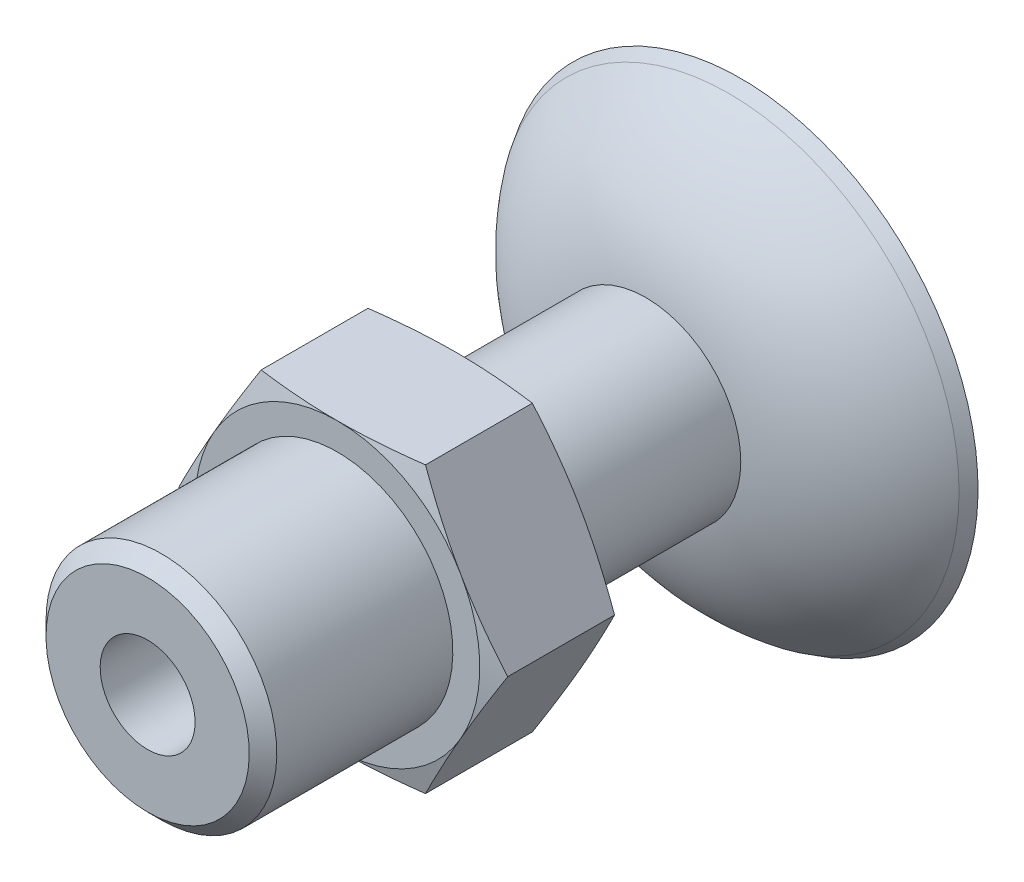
ISO-10303-21;
HEADER;
FILE_DESCRIPTION(('STEP AP214'),'2;1');
FILE_NAME('part.step','',(''),(''),'','','');
FILE_SCHEMA(('AUTOMOTIVE_DESIGN { 1 0 10303 214 1 1 1 1 }'));
ENDSEC;
DATA;
#1=APPLICATION_CONTEXT('core data for automotive mechanical design processes');
#2=APPLICATION_PROTOCOL_DEFINITION('international standard','automotive_design',2000,#1);
#3=PRODUCT_CONTEXT('',#1,'mechanical');
#4=PRODUCT('Part','Part','',(#3));
#5=PRODUCT_RELATED_PRODUCT_CATEGORY('part','',(#4));
#6=PRODUCT_DEFINITION_FORMATION('','',#4);
#7=PRODUCT_DEFINITION_CONTEXT('part definition',#1,'design');
#8=PRODUCT_DEFINITION('design','',#6,#7);
#9=PRODUCT_DEFINITION_SHAPE('','',#8);
#10=(LENGTH_UNIT() NAMED_UNIT(*) SI_UNIT(.MILLI.,.METRE.));
#11=(NAMED_UNIT(*) PLANE_ANGLE_UNIT() SI_UNIT($,.RADIAN.));
#12=(NAMED_UNIT(*) SI_UNIT($,.STERADIAN.) SOLID_ANGLE_UNIT());
#13=UNCERTAINTY_MEASURE_WITH_UNIT(LENGTH_MEASURE(1.E-05),#10,'distance_accuracy_value','');
#14=(GEOMETRIC_REPRESENTATION_CONTEXT(3) GLOBAL_UNCERTAINTY_ASSIGNED_CONTEXT((#13)) GLOBAL_UNIT_ASSIGNED_CONTEXT((#10,
#11,#12)) REPRESENTATION_CONTEXT('',''));
#15=CARTESIAN_POINT('',(0.,0.,0.));
#16=DIRECTION('',(0.,0.,1.));
#17=DIRECTION('',(1.,0.,0.));
#18=AXIS2_PLACEMENT_3D('',#15,#16,#17);
#19=CARTESIAN_POINT('',(6.92820323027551,0.,12.));
#20=DIRECTION('',(0.866025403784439,0.5,0.));
#21=DIRECTION('',(0.,0.,1.));
#22=AXIS2_PLACEMENT_3D('',#19,#20,#21);
#23=PLANE('',#22);
#24=DIRECTION('',(0.,0.,1.));
#25=VECTOR('',#24,1.);
#26=CARTESIAN_POINT('',(3.46410161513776,6.,12.));
#27=LINE('',#26,#25);
#28=CARTESIAN_POINT('',(3.46410161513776,6.,12.2487113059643));
#29=VERTEX_POINT('',#28);
#30=CARTESIAN_POINT('',(3.46410161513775,6.,16.7512886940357));
#31=VERTEX_POINT('',#30);
#32=EDGE_CURVE('E10',#29,#31,#27,.T.);
#33=ORIENTED_EDGE('',*,*,#32,.T.);
#34=CARTESIAN_POINT('',(5.19615242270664,3.00000000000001,17.));
#35=CARTESIAN_POINT('',(5.12404359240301,3.12480967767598,17.0000199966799));
#36=CARTESIAN_POINT('',(5.05188034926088,3.24958799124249,16.9986484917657));
#37=CARTESIAN_POINT('',(4.90798279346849,3.49847134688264,16.9931540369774));
#38=CARTESIAN_POINT('',(4.83624819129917,3.62257653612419,16.9890453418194));
#39=CARTESIAN_POINT('',(4.6926345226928,3.87142043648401,16.9780801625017));
#40=CARTESIAN_POINT('',(4.62075656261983,3.99615917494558,16.9712098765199));
#41=CARTESIAN_POINT('',(4.47601669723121,4.24735284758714,16.9547641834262));
#42=CARTESIAN_POINT('',(4.40315594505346,4.37380590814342,16.9451503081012));
#43=CARTESIAN_POINT('',(4.2592900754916,4.62306506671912,16.9237525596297));
#44=CARTESIAN_POINT('',(4.18828746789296,4.74587821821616,16.912033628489));
#45=CARTESIAN_POINT('',(4.04576334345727,4.99249350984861,16.8862377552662));
#46=CARTESIAN_POINT('',(3.97424314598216,5.11629421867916,16.8721398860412));
#47=CARTESIAN_POINT('',(3.83027325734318,5.36560571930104,16.8416075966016));
#48=CARTESIAN_POINT('',(3.75782595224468,5.49111391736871,16.8251409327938));
#49=CARTESIAN_POINT('',(3.61160134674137,5.74445673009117,16.7898805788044));
#50=CARTESIAN_POINT('',(3.53782665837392,5.87228726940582,16.7710466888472));
#51=CARTESIAN_POINT('',(3.46410161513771,5.99999999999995,16.7512886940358));
#52=B_SPLINE_CURVE_WITH_KNOTS('',3,(#34,#35,#36,#37,#38,#39,#40,#41,#42,#43,#44,#45,#46,#47,#48,
#49,#50,#51),.UNSPECIFIED.,.F.,.F.,(4,2,2,2,2,2,2,2,4),(0.,0.432421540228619,0.862608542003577,
1.29497279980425,1.73372521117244,2.16073850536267,2.59172526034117,3.02925966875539,
3.47560935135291),.UNSPECIFIED.);
#53=CARTESIAN_POINT('',(5.19615242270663,3.,17.));
#54=VERTEX_POINT('',#53);
#55=EDGE_CURVE('E550',#54,#31,#52,.T.);
#56=ORIENTED_EDGE('',*,*,#55,.F.);
#57=CARTESIAN_POINT('',(6.92820323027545,0.,16.7512886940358));
#58=CARTESIAN_POINT('',(6.85446990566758,0.127692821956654,16.7710449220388));
#59=CARTESIAN_POINT('',(6.78066033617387,0.255488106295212,16.7898769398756));
#60=CARTESIAN_POINT('',(6.63438238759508,0.508780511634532,16.8251348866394));
#61=CARTESIAN_POINT('',(6.56191621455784,0.634273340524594,16.841600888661));
#62=CARTESIAN_POINT('',(6.41799291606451,0.883612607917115,16.8721331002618));
#63=CARTESIAN_POINT('',(6.3465368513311,1.00745570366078,16.8862314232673));
#64=CARTESIAN_POINT('',(6.20421306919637,1.25420625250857,16.9120298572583));
#65=CARTESIAN_POINT('',(6.13334596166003,1.37711187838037,16.9237507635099));
#66=CARTESIAN_POINT('',(5.98940836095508,1.62632912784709,16.9451502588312));
#67=CARTESIAN_POINT('',(5.91633055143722,1.75264209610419,16.9547643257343));
#68=CARTESIAN_POINT('',(5.77116669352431,2.00357128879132,16.9712102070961));
#69=CARTESIAN_POINT('',(5.69908163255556,2.12818555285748,16.9780803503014));
#70=CARTESIAN_POINT('',(5.55538561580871,2.37698191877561,16.9890454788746));
#71=CARTESIAN_POINT('',(5.48377408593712,2.50116308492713,16.9931541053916));
#72=CARTESIAN_POINT('',(5.34017760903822,2.75023994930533,16.9986485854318));
#73=CARTESIAN_POINT('',(5.26819267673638,2.87513597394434,17.0000200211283));
#74=CARTESIAN_POINT('',(5.19615242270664,3.00000000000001,17.));
#75=B_SPLINE_CURVE_WITH_KNOTS('',3,(#57,#58,#59,#60,#61,#62,#63,#64,#65,#66,#67,#68,#69,#70,#71,
#72,#73,#74),.UNSPECIFIED.,.F.,.F.,(4,2,2,2,2,2,2,2,4),(0.,0.446310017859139,0.883832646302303,
1.31483340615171,1.74188406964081,2.18059822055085,2.61294971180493,3.04314949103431,
3.47560937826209),.UNSPECIFIED.);
#76=CARTESIAN_POINT('',(6.92820323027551,0.,16.7512886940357));
#77=VERTEX_POINT('',#76);
#78=EDGE_CURVE('E546',#77,#54,#75,.T.);
#79=ORIENTED_EDGE('',*,*,#78,.F.);
#80=DIRECTION('',(0.,0.,1.));
#81=VECTOR('',#80,1.);
#82=CARTESIAN_POINT('',(6.92820323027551,0.,12.));
#83=LINE('',#82,#81);
#84=CARTESIAN_POINT('',(6.92820323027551,0.,12.2487113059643));
#85=VERTEX_POINT('',#84);
#86=EDGE_CURVE('E464',#85,#77,#83,.T.);
#87=ORIENTED_EDGE('',*,*,#86,.F.);
#88=CARTESIAN_POINT('',(5.19615242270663,3.,12.));
#89=CARTESIAN_POINT('',(5.26818635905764,2.87514708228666,11.9999800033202));
#90=CARTESIAN_POINT('',(5.34016592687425,2.75026272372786,12.0013515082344));
#91=CARTESIAN_POINT('',(5.48375645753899,2.50120210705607,12.0068459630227));
#92=CARTESIAN_POINT('',(5.55536740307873,2.37702552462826,12.0109546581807));
#93=CARTESIAN_POINT('',(5.69906570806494,2.12823048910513,12.0219198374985));
#94=CARTESIAN_POINT('',(5.77115364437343,2.00361298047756,12.0287901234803));
#95=CARTESIAN_POINT('',(5.91632381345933,1.75266774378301,12.0452358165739));
#96=CARTESIAN_POINT('',(5.98940500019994,1.6263419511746,12.0548496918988));
#97=CARTESIAN_POINT('',(6.13333682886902,1.377120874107,12.0762474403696));
#98=CARTESIAN_POINT('',(6.20419483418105,1.25422423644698,12.0879663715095));
#99=CARTESIAN_POINT('',(6.34650787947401,1.00748707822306,12.1137622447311));
#100=CARTESIAN_POINT('',(6.41796233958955,0.883648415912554,12.1278601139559));
#101=CARTESIAN_POINT('',(6.56188748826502,0.634311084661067,12.1583924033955));
#102=CARTESIAN_POINT('',(6.63435712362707,0.50881577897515,12.1748590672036));
#103=CARTESIAN_POINT('',(6.78064613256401,0.25551014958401,12.210119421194));
#104=CARTESIAN_POINT('',(6.8544632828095,0.127704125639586,12.2289533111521));
#105=CARTESIAN_POINT('',(6.92820323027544,0.,12.2487113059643));
#106=B_SPLINE_CURVE_WITH_KNOTS('',3,(#88,#89,#90,#91,#92,#93,#94,#95,#96,#97,#98,#99,#100,#101,
#102,#103,#104,#105),.UNSPECIFIED.,.F.,.F.,(4,2,2,2,2,2,2,2,4),(0.,0.432421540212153,
0.862608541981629,1.29497279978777,1.73372521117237,2.16073850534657,2.59172526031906,
3.02925966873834,3.47560935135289),.UNSPECIFIED.);
#107=CARTESIAN_POINT('',(5.19615242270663,3.,12.));
#108=VERTEX_POINT('',#107);
#109=EDGE_CURVE('E690',#108,#85,#106,.T.);
#110=ORIENTED_EDGE('',*,*,#109,.F.);
#111=CARTESIAN_POINT('',(3.46410161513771,5.99999999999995,12.2487113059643));
#112=CARTESIAN_POINT('',(3.53782018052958,5.87229865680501,12.2289550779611));
#113=CARTESIAN_POINT('',(3.61158935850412,5.74448005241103,12.2101230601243));
#114=CARTESIAN_POINT('',(3.75780804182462,5.49115343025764,12.1748651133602));
#115=CARTESIAN_POINT('',(3.83025493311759,5.36564946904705,12.1583991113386));
#116=CARTESIAN_POINT('',(3.97422742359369,5.11633860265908,12.1278668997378));
#117=CARTESIAN_POINT('',(4.04575065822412,4.99253428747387,12.1137685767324));
#118=CARTESIAN_POINT('',(4.1882810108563,4.74590300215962,12.0879701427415));
#119=CARTESIAN_POINT('',(4.25928685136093,4.6230774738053,12.0762492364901));
#120=CARTESIAN_POINT('',(4.4031465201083,4.37381523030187,12.0548497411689));
#121=CARTESIAN_POINT('',(4.47599785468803,4.24737150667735,12.0452356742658));
#122=CARTESIAN_POINT('',(4.62072698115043,3.996191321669,12.028789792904));
#123=CARTESIAN_POINT('',(4.69260356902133,3.87145669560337,12.0219196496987));
#124=CARTESIAN_POINT('',(4.83621953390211,3.62261411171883,12.0109545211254));
#125=CARTESIAN_POINT('',(4.90795781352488,3.49850612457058,12.0068458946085));
#126=CARTESIAN_POINT('',(5.05186646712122,3.24960949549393,12.0013514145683));
#127=CARTESIAN_POINT('',(5.12403713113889,3.12482070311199,11.9999799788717));
#128=CARTESIAN_POINT('',(5.19615242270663,3.,12.));
#129=B_SPLINE_CURVE_WITH_KNOTS('',3,(#111,#112,#113,#114,#115,#116,#117,#118,#119,#120,#121,
#122,#123,#124,#125,#126,#127,#128),.UNSPECIFIED.,.F.,.F.,(4,2,2,2,2,2,2,2,4),(0.,
0.446310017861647,0.883832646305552,1.31483340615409,1.74188406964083,2.18059822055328,
2.61294971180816,3.04314949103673,3.47560937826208),.UNSPECIFIED.);
#130=EDGE_CURVE('E178',#29,#108,#129,.T.);
#131=ORIENTED_EDGE('',*,*,#130,.F.);
#132=EDGE_LOOP('',(#33,#56,#79,#87,#110,#131));
#133=FACE_BOUND('',#132,.T.);
#134=ADVANCED_FACE('F15',(#133),#23,.T.);
#135=CARTESIAN_POINT('',(3.46410161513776,6.,12.));
#136=DIRECTION('',(0.,1.,0.));
#137=DIRECTION('',(-1.,0.,0.));
#138=AXIS2_PLACEMENT_3D('',#135,#136,#137);
#139=PLANE('',#138);
#140=DIRECTION('',(0.,0.,1.));
#141=VECTOR('',#140,1.);
#142=CARTESIAN_POINT('',(-3.46410161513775,6.,12.));
#143=LINE('',#142,#141);
#144=CARTESIAN_POINT('',(-3.46410161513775,6.,12.2487113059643));
#145=VERTEX_POINT('',#144);
#146=CARTESIAN_POINT('',(-3.46410161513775,6.,16.7512886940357));
#147=VERTEX_POINT('',#146);
#148=EDGE_CURVE('E29',#145,#147,#143,.T.);
#149=ORIENTED_EDGE('',*,*,#148,.T.);
#150=CARTESIAN_POINT('',(0.,6.00000000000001,17.));
#151=CARTESIAN_POINT('',(-0.144124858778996,5.99995669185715,17.0000200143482));
#152=CARTESIAN_POINT('',(-0.288249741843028,5.99985529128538,16.998647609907));
#153=CARTESIAN_POINT('',(-0.575724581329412,5.99969177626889,16.9931504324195));
#154=CARTESIAN_POINT('',(-0.719074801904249,5.9996294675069,16.9890394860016));
#155=CARTESIAN_POINT('',(-1.00641973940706,5.99969625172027,16.9780688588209));
#156=CARTESIAN_POINT('',(-1.15041390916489,5.99982634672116,16.9711949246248));
#157=CARTESIAN_POINT('',(-1.44040510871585,6.00008659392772,16.9547411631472));
#158=CARTESIAN_POINT('',(-1.58639991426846,6.00021671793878,16.9451224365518));
#159=CARTESIAN_POINT('',(-1.87425873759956,6.00025188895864,16.9237187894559));
#160=CARTESIAN_POINT('',(-2.01612766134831,6.0001629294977,16.9119995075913));
#161=CARTESIAN_POINT('',(-2.30096544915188,6.00002759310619,16.8862047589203));
#162=CARTESIAN_POINT('',(-2.44393243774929,5.99998161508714,16.8721086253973));
#163=CARTESIAN_POINT('',(-2.73179478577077,5.9999399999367,16.8415817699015));
#164=CARTESIAN_POINT('',(-2.87668673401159,5.99994513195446,16.8251190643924));
#165=CARTESIAN_POINT('',(-3.1691318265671,5.99997062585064,16.7898686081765));
#166=CARTESIAN_POINT('',(-3.31668016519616,5.99999129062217,16.7710409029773));
#167=CARTESIAN_POINT('',(-3.46410161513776,6.00000000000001,16.7512886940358));
#168=B_SPLINE_CURVE_WITH_KNOTS('',3,(#150,#151,#152,#153,#154,#155,#156,#157,#158,#159,#160,
#161,#162,#163,#164,#165,#166,#167),.UNSPECIFIED.,.F.,.F.,(4,2,2,2,2,2,2,2,4),(0.,
0.432367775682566,0.862568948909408,1.29501848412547,1.73393012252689,2.16096837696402,
2.59193173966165,3.02939030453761,3.47560819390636),.UNSPECIFIED.);
#169=CARTESIAN_POINT('',(0.,6.,17.));
#170=VERTEX_POINT('',#169);
#171=EDGE_CURVE('E500',#170,#147,#168,.T.);
#172=ORIENTED_EDGE('',*,*,#171,.F.);
#173=CARTESIAN_POINT('',(3.46410161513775,6.00000000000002,16.7512886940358));
#174=CARTESIAN_POINT('',(3.31726869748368,5.99999159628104,16.7709619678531));
#175=CARTESIAN_POINT('',(3.17031004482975,5.99996749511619,16.7897190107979));
#176=CARTESIAN_POINT('',(2.8790373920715,5.99993021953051,16.8248474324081));
#177=CARTESIAN_POINT('',(2.73472816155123,5.9999168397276,16.8412584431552));
#178=CARTESIAN_POINT('',(2.44803367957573,5.99993958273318,16.8717010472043));
#179=CARTESIAN_POINT('',(2.30565182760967,5.99997497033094,16.8857644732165));
#180=CARTESIAN_POINT('',(2.02199764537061,6.00008886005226,16.9115131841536));
#181=CARTESIAN_POINT('',(1.88072720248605,6.00016696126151,16.923219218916));
#182=CARTESIAN_POINT('',(1.59291852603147,6.00012156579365,16.9447025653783));
#183=CARTESIAN_POINT('',(1.44637393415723,5.99999070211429,16.9543951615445));
#184=CARTESIAN_POINT('',(1.15526705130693,5.99974077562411,16.9709752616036));
#185=CARTESIAN_POINT('',(1.01070698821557,5.99962156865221,16.9779015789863));
#186=CARTESIAN_POINT('',(0.722199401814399,5.99958067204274,16.9889562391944));
#187=CARTESIAN_POINT('',(0.578252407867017,5.99965800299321,16.9930983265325));
#188=CARTESIAN_POINT('',(0.289537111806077,5.99984558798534,16.9986377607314));
#189=CARTESIAN_POINT('',(0.144768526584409,5.99995601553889,17.0000203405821));
#190=CARTESIAN_POINT('',(0.,6.00000000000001,17.));
#191=B_SPLINE_CURVE_WITH_KNOTS('',3,(#173,#174,#175,#176,#177,#178,#179,#180,#181,#182,#183,
#184,#185,#186,#187,#188,#189,#190),.UNSPECIFIED.,.F.,.F.,(4,2,2,2,2,2,2,2,4),(0.,
0.444436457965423,0.880140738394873,1.30934776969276,1.73459368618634,2.17516540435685,
2.6093178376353,3.04131099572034,3.47560975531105),.UNSPECIFIED.);
#192=EDGE_CURVE('E585',#31,#170,#191,.T.);
#193=ORIENTED_EDGE('',*,*,#192,.F.);
#194=ORIENTED_EDGE('',*,*,#32,.F.);
#195=CARTESIAN_POINT('',(0.,6.,12.));
#196=CARTESIAN_POINT('',(0.144124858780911,5.99995669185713,11.9999799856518));
#197=CARTESIAN_POINT('',(0.288249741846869,5.99985529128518,12.001352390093));
#198=CARTESIAN_POINT('',(0.575724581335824,5.99969177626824,12.0068495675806));
#199=CARTESIAN_POINT('',(0.719074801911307,5.99962946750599,12.0109605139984));
#200=CARTESIAN_POINT('',(1.00641973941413,5.99969625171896,12.0219311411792));
#201=CARTESIAN_POINT('',(1.15041390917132,5.99982634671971,12.0288050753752));
#202=CARTESIAN_POINT('',(1.4404051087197,6.00008659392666,12.0452588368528));
#203=CARTESIAN_POINT('',(1.58639991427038,6.00021671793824,12.0548775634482));
#204=CARTESIAN_POINT('',(1.87425873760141,6.00025188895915,12.0762812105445));
#205=CARTESIAN_POINT('',(2.01612766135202,6.00016292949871,12.0880004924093));
#206=CARTESIAN_POINT('',(2.30096544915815,6.0000275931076,12.1137952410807));
#207=CARTESIAN_POINT('',(2.44393243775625,5.99998161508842,12.1278913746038));
#208=CARTESIAN_POINT('',(2.73179478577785,5.9999399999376,12.1584182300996));
#209=CARTESIAN_POINT('',(2.87668673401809,5.99994513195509,12.1748809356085));
#210=CARTESIAN_POINT('',(3.16913182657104,5.99997062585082,12.210131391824));
#211=CARTESIAN_POINT('',(3.31668016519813,5.99999129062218,12.228959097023));
#212=CARTESIAN_POINT('',(3.46410161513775,6.00000000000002,12.2487113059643));
#213=B_SPLINE_CURVE_WITH_KNOTS('',3,(#195,#196,#197,#198,#199,#200,#201,#202,#203,#204,#205,
#206,#207,#208,#209,#210,#211,#212),.UNSPECIFIED.,.F.,.F.,(4,2,2,2,2,2,2,2,4),(0.,
0.432367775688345,0.862568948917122,1.29501848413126,1.73393012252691,2.16096837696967,
2.59193173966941,3.02939030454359,3.47560819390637),.UNSPECIFIED.);
#214=CARTESIAN_POINT('',(0.,6.,12.));
#215=VERTEX_POINT('',#214);
#216=EDGE_CURVE('E186',#215,#29,#213,.T.);
#217=ORIENTED_EDGE('',*,*,#216,.F.);
#218=CARTESIAN_POINT('',(-3.46410161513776,6.00000000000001,12.2487113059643));
#219=CARTESIAN_POINT('',(-3.31726869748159,5.99999159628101,12.2290380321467));
#220=CARTESIAN_POINT('',(-3.17031004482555,5.99996749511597,12.2102809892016));
#221=CARTESIAN_POINT('',(-2.87903739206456,5.99993021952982,12.1751525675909));
#222=CARTESIAN_POINT('',(-2.73472816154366,5.99991683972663,12.1587415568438));
#223=CARTESIAN_POINT('',(-2.44803367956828,5.9999395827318,12.1282989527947));
#224=CARTESIAN_POINT('',(-2.30565182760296,5.99997497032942,12.1142355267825));
#225=CARTESIAN_POINT('',(-2.02199764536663,6.00008886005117,12.0884868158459));
#226=CARTESIAN_POINT('',(-1.88072720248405,6.00016696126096,12.0767807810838));
#227=CARTESIAN_POINT('',(-1.5929185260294,6.00012156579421,12.0552974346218));
#228=CARTESIAN_POINT('',(-1.4463739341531,5.99999070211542,12.0456048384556));
#229=CARTESIAN_POINT('',(-1.15526705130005,5.99974077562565,12.0290247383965));
#230=CARTESIAN_POINT('',(-1.01070698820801,5.9996215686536,12.0220984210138));
#231=CARTESIAN_POINT('',(-0.722199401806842,5.99958067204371,12.0110437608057));
#232=CARTESIAN_POINT('',(-0.578252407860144,5.99965800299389,12.0069016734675));
#233=CARTESIAN_POINT('',(-0.289537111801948,5.99984558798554,12.0013622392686));
#234=CARTESIAN_POINT('',(-0.144768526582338,5.9999560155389,11.9999796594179));
#235=CARTESIAN_POINT('',(0.,6.,12.));
#236=B_SPLINE_CURVE_WITH_KNOTS('',3,(#218,#219,#220,#221,#222,#223,#224,#225,#226,#227,#228,
#229,#230,#231,#232,#233,#234,#235),.UNSPECIFIED.,.F.,.F.,(4,2,2,2,2,2,2,2,4),(0.,
0.44443645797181,0.880140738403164,1.3093477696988,1.73459368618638,2.17516540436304,
2.60931783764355,3.04131099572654,3.47560975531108),.UNSPECIFIED.);
#237=EDGE_CURVE('E652',#145,#215,#236,.T.);
#238=ORIENTED_EDGE('',*,*,#237,.F.);
#239=EDGE_LOOP('',(#149,#172,#193,#194,#217,#238));
#240=FACE_BOUND('',#239,.T.);
#241=ADVANCED_FACE('F247',(#240),#139,.T.);
#242=CARTESIAN_POINT('',(-3.46410161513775,6.,12.));
#243=DIRECTION('',(-0.866025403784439,0.5,0.));
#244=DIRECTION('',(0.,0.,-1.));
#245=AXIS2_PLACEMENT_3D('',#242,#243,#244);
#246=PLANE('',#245);
#247=DIRECTION('',(0.,0.,1.));
#248=VECTOR('',#247,1.);
#249=CARTESIAN_POINT('',(-6.92820323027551,0.,12.));
#250=LINE('',#249,#248);
#251=CARTESIAN_POINT('',(-6.92820323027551,0.,12.2487113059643));
#252=VERTEX_POINT('',#251);
#253=CARTESIAN_POINT('',(-6.92820323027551,0.,16.7512886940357));
#254=VERTEX_POINT('',#253);
#255=EDGE_CURVE('E593',#252,#254,#250,.T.);
#256=ORIENTED_EDGE('',*,*,#255,.T.);
#257=CARTESIAN_POINT('',(-5.19615242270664,3.,17.));
#258=CARTESIAN_POINT('',(-5.26818635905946,2.87514708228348,17.0000199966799));
#259=CARTESIAN_POINT('',(-5.3401659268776,2.75026272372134,16.9986484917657));
#260=CARTESIAN_POINT('',(-5.48375645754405,2.5012021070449,16.9931540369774));
#261=CARTESIAN_POINT('',(-5.55536740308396,2.37702552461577,16.9890453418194));
#262=CARTESIAN_POINT('',(-5.69906570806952,2.12823048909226,16.9780801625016));
#263=CARTESIAN_POINT('',(-5.77115364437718,2.00361298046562,16.9712098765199));
#264=CARTESIAN_POINT('',(-5.91632381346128,1.75266774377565,16.9547641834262));
#265=CARTESIAN_POINT('',(-5.98940500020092,1.62634195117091,16.9451503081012));
#266=CARTESIAN_POINT('',(-6.13333682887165,1.37712087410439,16.9237525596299));
#267=CARTESIAN_POINT('',(-6.20419483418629,1.25422423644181,16.9120336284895));
#268=CARTESIAN_POINT('',(-6.34650787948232,1.00748707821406,16.8862377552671));
#269=CARTESIAN_POINT('',(-6.41796233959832,0.883648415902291,16.8721398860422));
#270=CARTESIAN_POINT('',(-6.56188748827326,0.634311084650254,16.8416075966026));
#271=CARTESIAN_POINT('',(-6.63435712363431,0.508815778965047,16.8251409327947));
#272=CARTESIAN_POINT('',(-6.78064613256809,0.255510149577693,16.789880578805));
#273=CARTESIAN_POINT('',(-6.85446328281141,0.127704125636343,16.7710466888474));
#274=CARTESIAN_POINT('',(-6.92820323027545,0.,16.7512886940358));
#275=B_SPLINE_CURVE_WITH_KNOTS('',3,(#257,#258,#259,#260,#261,#262,#263,#264,#265,#266,#267,
#268,#269,#270,#271,#272,#273,#274),.UNSPECIFIED.,.F.,.F.,(4,2,2,2,2,2,2,2,4),(0.,
0.432421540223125,0.86260854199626,1.29497279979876,1.73372521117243,2.16073850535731,
2.5917252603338,3.02925966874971,3.47560935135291),.UNSPECIFIED.);
#276=CARTESIAN_POINT('',(-5.19615242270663,3.,17.));
#277=VERTEX_POINT('',#276);
#278=EDGE_CURVE('E233',#277,#254,#275,.T.);
#279=ORIENTED_EDGE('',*,*,#278,.F.);
#280=CARTESIAN_POINT('',(-3.46410161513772,5.99999999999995,16.7512886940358));
#281=CARTESIAN_POINT('',(-3.53782018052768,5.87229865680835,16.7710449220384));
#282=CARTESIAN_POINT('',(-3.6115893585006,5.74448005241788,16.7898769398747));
#283=CARTESIAN_POINT('',(-3.75780804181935,5.49115343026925,16.825134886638));
#284=CARTESIAN_POINT('',(-3.8302549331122,5.36564946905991,16.8416008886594));
#285=CARTESIAN_POINT('',(-3.97422742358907,5.11633860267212,16.8721331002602));
#286=CARTESIAN_POINT('',(-4.04575065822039,4.99253428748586,16.8862314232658));
#287=CARTESIAN_POINT('',(-4.18828101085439,4.74590300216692,16.9120298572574));
#288=CARTESIAN_POINT('',(-4.25928685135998,4.62307747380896,16.9237507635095));
#289=CARTESIAN_POINT('',(-4.40314652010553,4.37381523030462,16.9451502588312));
#290=CARTESIAN_POINT('',(-4.4759978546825,4.24737150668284,16.9547643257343));
#291=CARTESIAN_POINT('',(-4.62072698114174,3.99619132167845,16.9712102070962));
#292=CARTESIAN_POINT('',(-4.69260356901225,3.87145669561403,16.9780803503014));
#293=CARTESIAN_POINT('',(-4.8362195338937,3.62261411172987,16.9890454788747));
#294=CARTESIAN_POINT('',(-4.90795781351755,3.49850612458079,16.9931541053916));
#295=CARTESIAN_POINT('',(-5.05186646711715,3.24960949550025,16.9986485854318));
#296=CARTESIAN_POINT('',(-5.12403713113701,3.12482070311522,17.0000200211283));
#297=CARTESIAN_POINT('',(-5.19615242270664,3.,17.));
#298=B_SPLINE_CURVE_WITH_KNOTS('',3,(#280,#281,#282,#283,#284,#285,#286,#287,#288,#289,#290,
#291,#292,#293,#294,#295,#296,#297),.UNSPECIFIED.,.F.,.F.,(4,2,2,2,2,2,2,2,4),(0.,
0.446310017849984,0.883832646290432,1.31483340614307,1.74188406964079,2.18059822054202,
2.61294971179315,3.04314949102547,3.47560937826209),.UNSPECIFIED.);
#299=EDGE_CURVE('E525',#147,#277,#298,.T.);
#300=ORIENTED_EDGE('',*,*,#299,.F.);
#301=ORIENTED_EDGE('',*,*,#148,.F.);
#302=CARTESIAN_POINT('',(-5.19615242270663,3.,12.));
#303=CARTESIAN_POINT('',(-5.12404359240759,3.12480967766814,11.9999800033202));
#304=CARTESIAN_POINT('',(-5.05188034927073,3.24958799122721,12.0013515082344));
#305=CARTESIAN_POINT('',(-4.90798279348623,3.49847134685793,12.0068459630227));
#306=CARTESIAN_POINT('',(-4.83624819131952,3.62257653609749,12.0109546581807));
#307=CARTESIAN_POINT('',(-4.69263452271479,3.87142043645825,12.0219198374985));
#308=CARTESIAN_POINT('',(-4.62075656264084,3.99615917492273,12.0287901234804));
#309=CARTESIAN_POINT('',(-4.47601669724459,4.24735284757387,12.045235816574));
#310=CARTESIAN_POINT('',(-4.40315594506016,4.37380590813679,12.0548496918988));
#311=CARTESIAN_POINT('',(-4.25929007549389,4.62306506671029,12.0762474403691));
#312=CARTESIAN_POINT('',(-4.18828746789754,4.74587821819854,12.0879663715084));
#313=CARTESIAN_POINT('',(-4.04576334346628,4.99249350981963,12.1137622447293));
#314=CARTESIAN_POINT('',(-3.97424314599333,5.11629421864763,12.127860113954));
#315=CARTESIAN_POINT('',(-3.83027325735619,5.36560571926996,12.1583924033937));
#316=CARTESIAN_POINT('',(-3.7578259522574,5.49111391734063,12.1748590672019));
#317=CARTESIAN_POINT('',(-3.61160134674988,5.74445673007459,12.210119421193));
#318=CARTESIAN_POINT('',(-3.53782665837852,5.87228726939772,12.2289533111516));
#319=CARTESIAN_POINT('',(-3.46410161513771,5.99999999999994,12.2487113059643));
#320=B_SPLINE_CURVE_WITH_KNOTS('',3,(#302,#303,#304,#305,#306,#307,#308,#309,#310,#311,#312,
#313,#314,#315,#316,#317,#318,#319),.UNSPECIFIED.,.F.,.F.,(4,2,2,2,2,2,2,2,4),(0.,
0.432421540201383,0.862608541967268,1.294972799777,1.73372521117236,2.16073850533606,
2.59172526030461,3.0292596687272,3.47560935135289),.UNSPECIFIED.);
#321=CARTESIAN_POINT('',(-5.19615242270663,3.,12.));
#322=VERTEX_POINT('',#321);
#323=EDGE_CURVE('E648',#322,#145,#320,.T.);
#324=ORIENTED_EDGE('',*,*,#323,.F.);
#325=CARTESIAN_POINT('',(-6.92820323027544,0.,12.2487113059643));
#326=CARTESIAN_POINT('',(-6.85446990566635,0.127692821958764,12.2289550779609));
#327=CARTESIAN_POINT('',(-6.78066033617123,0.255488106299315,12.2101230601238));
#328=CARTESIAN_POINT('',(-6.63438238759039,0.508780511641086,12.1748651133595));
#329=CARTESIAN_POINT('',(-6.5619162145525,0.634273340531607,12.1583991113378));
#330=CARTESIAN_POINT('',(-6.41799291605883,0.883612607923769,12.127866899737));
#331=CARTESIAN_POINT('',(-6.34653685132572,1.00745570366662,12.1137685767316));
#332=CARTESIAN_POINT('',(-6.20421306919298,1.25420625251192,12.0879701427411));
#333=CARTESIAN_POINT('',(-6.13334596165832,1.37711187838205,12.0762492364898));
#334=CARTESIAN_POINT('',(-5.98940836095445,1.62632912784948,12.0548497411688));
#335=CARTESIAN_POINT('',(-5.91633055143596,1.75264209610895,12.0452356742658));
#336=CARTESIAN_POINT('',(-5.77116669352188,2.00357128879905,12.028789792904));
#337=CARTESIAN_POINT('',(-5.69908163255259,2.12818555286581,12.0219196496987));
#338=CARTESIAN_POINT('',(-5.55538561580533,2.37698191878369,12.0109545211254));
#339=CARTESIAN_POINT('',(-5.48377408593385,2.50116308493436,12.0068458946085));
#340=CARTESIAN_POINT('',(-5.34017760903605,2.75023994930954,12.0013514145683));
#341=CARTESIAN_POINT('',(-5.2681926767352,2.87513597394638,11.9999799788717));
#342=CARTESIAN_POINT('',(-5.19615242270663,3.,12.));
#343=B_SPLINE_CURVE_WITH_KNOTS('',3,(#325,#326,#327,#328,#329,#330,#331,#332,#333,#334,#335,
#336,#337,#338,#339,#340,#341,#342),.UNSPECIFIED.,.F.,.F.,(4,2,2,2,2,2,2,2,4),(0.,
0.446310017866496,0.883832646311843,1.31483340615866,1.74188406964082,2.18059822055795,
2.6129497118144,3.0431494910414,3.47560937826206),.UNSPECIFIED.);
#344=EDGE_CURVE('E286',#252,#322,#343,.T.);
#345=ORIENTED_EDGE('',*,*,#344,.F.);
#346=EDGE_LOOP('',(#256,#279,#300,#301,#324,#345));
#347=FACE_BOUND('',#346,.T.);
#348=ADVANCED_FACE('F237',(#347),#246,.T.);
#349=CARTESIAN_POINT('',(-6.92820323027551,0.,12.));
#350=DIRECTION('',(-0.866025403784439,-0.5,0.));
#351=DIRECTION('',(0.,0.,-1.));
#352=AXIS2_PLACEMENT_3D('',#349,#350,#351);
#353=PLANE('',#352);
#354=DIRECTION('',(0.,0.,1.));
#355=VECTOR('',#354,1.);
#356=CARTESIAN_POINT('',(-3.46410161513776,-6.,12.));
#357=LINE('',#356,#355);
#358=CARTESIAN_POINT('',(-3.46410161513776,-6.,12.2487113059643));
#359=VERTEX_POINT('',#358);
#360=CARTESIAN_POINT('',(-3.46410161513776,-6.,16.7512886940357));
#361=VERTEX_POINT('',#360);
#362=EDGE_CURVE('E463',#359,#361,#357,.T.);
#363=ORIENTED_EDGE('',*,*,#362,.T.);
#364=CARTESIAN_POINT('',(-5.19615242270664,-3.,17.));
#365=CARTESIAN_POINT('',(-5.12404359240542,-3.12480967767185,17.0000199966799));
#366=CARTESIAN_POINT('',(-5.05188034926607,-3.24958799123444,16.9986484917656));
#367=CARTESIAN_POINT('',(-4.90798279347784,-3.49847134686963,16.9931540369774));
#368=CARTESIAN_POINT('',(-4.83624819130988,-3.62257653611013,16.9890453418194));
#369=CARTESIAN_POINT('',(-4.69263452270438,-3.87142043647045,16.9780801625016));
#370=CARTESIAN_POINT('',(-4.6207565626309,-3.99615917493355,16.9712098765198));
#371=CARTESIAN_POINT('',(-4.47601669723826,-4.24735284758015,16.9547641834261));
#372=CARTESIAN_POINT('',(-4.403155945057,-4.37380590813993,16.9451503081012));
#373=CARTESIAN_POINT('',(-4.25929007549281,-4.62306506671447,16.9237525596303));
#374=CARTESIAN_POINT('',(-4.18828746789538,-4.74587821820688,16.9120336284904));
#375=CARTESIAN_POINT('',(-4.04576334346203,-4.99249350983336,16.8862377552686));
#376=CARTESIAN_POINT('',(-3.97424314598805,-5.11629421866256,16.8721398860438));
#377=CARTESIAN_POINT('',(-3.83027325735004,-5.36560571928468,16.8416075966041));
#378=CARTESIAN_POINT('',(-3.75782595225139,-5.49111391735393,16.8251409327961));
#379=CARTESIAN_POINT('',(-3.61160134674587,-5.74445673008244,16.7898805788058));
#380=CARTESIAN_POINT('',(-3.53782665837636,-5.87228726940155,16.7710466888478));
#381=CARTESIAN_POINT('',(-3.46410161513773,-5.99999999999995,16.7512886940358));
#382=B_SPLINE_CURVE_WITH_KNOTS('',3,(#364,#365,#366,#367,#368,#369,#370,#371,#372,#373,#374,
#375,#376,#377,#378,#379,#380,#381),.UNSPECIFIED.,.F.,.F.,(4,2,2,2,2,2,2,2,4),(0.,
0.432421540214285,0.862608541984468,1.2949727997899,1.7337252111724,2.16073850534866,
2.59172526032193,3.02925966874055,3.47560935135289),.UNSPECIFIED.);
#383=CARTESIAN_POINT('',(-5.19615242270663,-3.,17.));
#384=VERTEX_POINT('',#383);
#385=EDGE_CURVE('E167',#384,#361,#382,.T.);
#386=ORIENTED_EDGE('',*,*,#385,.F.);
#387=CARTESIAN_POINT('',(-6.92820323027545,0.,16.7512886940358));
#388=CARTESIAN_POINT('',(-6.85446990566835,-0.12769282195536,16.7710449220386));
#389=CARTESIAN_POINT('',(-6.78066033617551,-0.25548810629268,16.7898769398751));
#390=CARTESIAN_POINT('',(-6.634382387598,-0.508780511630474,16.8251348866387));
#391=CARTESIAN_POINT('',(-6.56191621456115,-0.634273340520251,16.8416008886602));
#392=CARTESIAN_POINT('',(-6.41799291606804,-0.883612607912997,16.872133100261));
#393=CARTESIAN_POINT('',(-6.34653685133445,-1.00745570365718,16.8862314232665));
#394=CARTESIAN_POINT('',(-6.20421306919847,-1.25420625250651,16.9120298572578));
#395=CARTESIAN_POINT('',(-6.13334596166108,-1.37711187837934,16.9237507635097));
#396=CARTESIAN_POINT('',(-5.98940836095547,-1.62632912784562,16.9451502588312));
#397=CARTESIAN_POINT('',(-5.916330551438,-1.75264209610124,16.9547643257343));
#398=CARTESIAN_POINT('',(-5.77116669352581,-2.00357128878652,16.9712102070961));
#399=CARTESIAN_POINT('',(-5.69908163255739,-2.1281855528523,16.9780803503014));
#400=CARTESIAN_POINT('',(-5.55538561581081,-2.37698191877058,16.9890454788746));
#401=CARTESIAN_POINT('',(-5.48377408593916,-2.50116308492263,16.9931541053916));
#402=CARTESIAN_POINT('',(-5.34017760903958,-2.7502399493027,16.9986485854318));
#403=CARTESIAN_POINT('',(-5.26819267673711,-2.87513597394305,17.0000200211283));
#404=CARTESIAN_POINT('',(-5.19615242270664,-3.,17.));
#405=B_SPLINE_CURVE_WITH_KNOTS('',3,(#387,#388,#389,#390,#391,#392,#393,#394,#395,#396,#397,
#398,#399,#400,#401,#402,#403,#404),.UNSPECIFIED.,.F.,.F.,(4,2,2,2,2,2,2,2,4),(0.,
0.446310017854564,0.88383264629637,1.3148334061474,1.7418840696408,2.18059822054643,
2.61294971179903,3.04314949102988,3.47560937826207),.UNSPECIFIED.);
#406=EDGE_CURVE('E159',#254,#384,#405,.T.);
#407=ORIENTED_EDGE('',*,*,#406,.F.);
#408=ORIENTED_EDGE('',*,*,#255,.F.);
#409=CARTESIAN_POINT('',(-5.19615242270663,-3.,12.));
#410=CARTESIAN_POINT('',(-5.268186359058,-2.87514708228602,11.9999800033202));
#411=CARTESIAN_POINT('',(-5.34016592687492,-2.75026272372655,12.0013515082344));
#412=CARTESIAN_POINT('',(-5.48375645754,-2.50120210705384,12.0068459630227));
#413=CARTESIAN_POINT('',(-5.55536740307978,-2.37702552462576,12.0109546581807));
#414=CARTESIAN_POINT('',(-5.69906570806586,-2.12823048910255,12.0219198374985));
#415=CARTESIAN_POINT('',(-5.77115364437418,-2.00361298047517,12.0287901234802));
#416=CARTESIAN_POINT('',(-5.91632381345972,-1.75266774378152,12.0452358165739));
#417=CARTESIAN_POINT('',(-5.98940500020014,-1.62634195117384,12.0548496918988));
#418=CARTESIAN_POINT('',(-6.13333682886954,-1.37712087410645,12.0762474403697));
#419=CARTESIAN_POINT('',(-6.2041948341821,-1.25422423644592,12.0879663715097));
#420=CARTESIAN_POINT('',(-6.34650787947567,-1.00748707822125,12.1137622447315));
#421=CARTESIAN_POINT('',(-6.4179623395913,-0.883648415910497,12.1278601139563));
#422=CARTESIAN_POINT('',(-6.56188748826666,-0.634311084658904,12.1583924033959));
#423=CARTESIAN_POINT('',(-6.63435712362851,-0.508815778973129,12.174859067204));
#424=CARTESIAN_POINT('',(-6.78064613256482,-0.255510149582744,12.2101194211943));
#425=CARTESIAN_POINT('',(-6.85446328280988,-0.127704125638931,12.2289533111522));
#426=CARTESIAN_POINT('',(-6.92820323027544,0.,12.2487113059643));
#427=B_SPLINE_CURVE_WITH_KNOTS('',3,(#409,#410,#411,#412,#413,#414,#415,#416,#417,#418,#419,
#420,#421,#422,#423,#424,#425,#426),.UNSPECIFIED.,.F.,.F.,(4,2,2,2,2,2,2,2,4),(0.,
0.43242154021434,0.862608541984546,1.29497279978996,1.7337252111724,2.16073850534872,
2.591725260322,3.0292596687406,3.4756093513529),.UNSPECIFIED.);
#428=CARTESIAN_POINT('',(-5.19615242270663,-3.,12.));
#429=VERTEX_POINT('',#428);
#430=EDGE_CURVE('E276',#429,#252,#427,.T.);
#431=ORIENTED_EDGE('',*,*,#430,.F.);
#432=CARTESIAN_POINT('',(-3.46410161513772,-5.99999999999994,12.2487113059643));
#433=CARTESIAN_POINT('',(-3.53782018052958,-5.872298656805,12.2289550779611));
#434=CARTESIAN_POINT('',(-3.61158935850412,-5.74448005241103,12.2101230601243));
#435=CARTESIAN_POINT('',(-3.75780804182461,-5.49115343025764,12.1748651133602));
#436=CARTESIAN_POINT('',(-3.83025493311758,-5.36564946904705,12.1583991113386));
#437=CARTESIAN_POINT('',(-3.97422742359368,-5.11633860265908,12.1278668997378));
#438=CARTESIAN_POINT('',(-4.04575065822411,-4.99253428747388,12.1137685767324));
#439=CARTESIAN_POINT('',(-4.18828101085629,-4.74590300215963,12.0879701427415));
#440=CARTESIAN_POINT('',(-4.25928685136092,-4.62307747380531,12.0762492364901));
#441=CARTESIAN_POINT('',(-4.40314652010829,-4.37381523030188,12.0548497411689));
#442=CARTESIAN_POINT('',(-4.47599785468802,-4.24737150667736,12.0452356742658));
#443=CARTESIAN_POINT('',(-4.62072698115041,-3.99619132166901,12.0287897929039));
#444=CARTESIAN_POINT('',(-4.69260356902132,-3.87145669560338,12.0219196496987));
#445=CARTESIAN_POINT('',(-4.8362195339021,-3.62261411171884,12.0109545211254));
#446=CARTESIAN_POINT('',(-4.90795781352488,-3.49850612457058,12.0068458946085));
#447=CARTESIAN_POINT('',(-5.05186646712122,-3.24960949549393,12.0013514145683));
#448=CARTESIAN_POINT('',(-5.1240371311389,-3.12482070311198,11.9999799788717));
#449=CARTESIAN_POINT('',(-5.19615242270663,-3.,12.));
#450=B_SPLINE_CURVE_WITH_KNOTS('',3,(#432,#433,#434,#435,#436,#437,#438,#439,#440,#441,#442,
#443,#444,#445,#446,#447,#448,#449),.UNSPECIFIED.,.F.,.F.,(4,2,2,2,2,2,2,2,4),(0.,
0.446310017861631,0.883832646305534,1.31483340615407,1.74188406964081,2.18059822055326,
2.61294971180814,3.04314949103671,3.47560937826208),.UNSPECIFIED.);
#451=EDGE_CURVE('E277',#359,#429,#450,.T.);
#452=ORIENTED_EDGE('',*,*,#451,.F.);
#453=EDGE_LOOP('',(#363,#386,#407,#408,#431,#452));
#454=FACE_BOUND('',#453,.T.);
#455=ADVANCED_FACE('F246',(#454),#353,.T.);
#456=CARTESIAN_POINT('',(-3.46410161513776,-6.,12.));
#457=DIRECTION('',(0.,-1.,0.));
#458=DIRECTION('',(0.,0.,-1.));
#459=AXIS2_PLACEMENT_3D('',#456,#457,#458);
#460=PLANE('',#459);
#461=DIRECTION('',(0.,0.,1.));
#462=VECTOR('',#461,1.);
#463=CARTESIAN_POINT('',(3.46410161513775,-6.,12.));
#464=LINE('',#463,#462);
#465=CARTESIAN_POINT('',(3.46410161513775,-6.,12.2487113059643));
#466=VERTEX_POINT('',#465);
#467=CARTESIAN_POINT('',(3.46410161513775,-6.,16.7512886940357));
#468=VERTEX_POINT('',#467);
#469=EDGE_CURVE('E142',#466,#468,#464,.T.);
#470=ORIENTED_EDGE('',*,*,#469,.T.);
#471=CARTESIAN_POINT('',(0.,-6.00000000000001,17.));
#472=CARTESIAN_POINT('',(0.14412485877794,-5.99995669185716,17.0000200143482));
#473=CARTESIAN_POINT('',(0.288249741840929,-5.99985529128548,16.998647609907));
#474=CARTESIAN_POINT('',(0.575724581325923,-5.99969177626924,16.9931504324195));
#475=CARTESIAN_POINT('',(0.719074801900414,-5.9996294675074,16.9890394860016));
#476=CARTESIAN_POINT('',(1.00641973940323,-5.99969625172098,16.9780688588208));
#477=CARTESIAN_POINT('',(1.15041390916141,-5.99982634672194,16.9711949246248));
#478=CARTESIAN_POINT('',(1.44040510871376,-6.00008659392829,16.9547411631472));
#479=CARTESIAN_POINT('',(1.58639991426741,-6.00021671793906,16.9451224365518));
#480=CARTESIAN_POINT('',(1.87425873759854,-6.00025188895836,16.923718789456));
#481=CARTESIAN_POINT('',(2.01612766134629,-6.00016292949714,16.9119995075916));
#482=CARTESIAN_POINT('',(2.30096544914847,-6.00002759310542,16.8862047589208));
#483=CARTESIAN_POINT('',(2.4439324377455,-5.99998161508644,16.8721086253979));
#484=CARTESIAN_POINT('',(2.73179478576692,-5.99993999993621,16.841581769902));
#485=CARTESIAN_POINT('',(2.87668673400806,-5.99994513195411,16.8251190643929));
#486=CARTESIAN_POINT('',(3.16913182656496,-5.99997062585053,16.7898686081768));
#487=CARTESIAN_POINT('',(3.31668016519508,-5.99999129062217,16.7710409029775));
#488=CARTESIAN_POINT('',(3.46410161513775,-6.00000000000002,16.7512886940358));
#489=B_SPLINE_CURVE_WITH_KNOTS('',3,(#471,#472,#473,#474,#475,#476,#477,#478,#479,#480,#481,
#482,#483,#484,#485,#486,#487,#488),.UNSPECIFIED.,.F.,.F.,(4,2,2,2,2,2,2,2,4),(0.,
0.432367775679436,0.862568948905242,1.29501848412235,1.73393012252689,2.16096837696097,
2.59193173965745,3.02939030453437,3.47560819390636),.UNSPECIFIED.);
#490=CARTESIAN_POINT('',(0.,-6.,17.));
#491=VERTEX_POINT('',#490);
#492=EDGE_CURVE('E131',#491,#468,#489,.T.);
#493=ORIENTED_EDGE('',*,*,#492,.F.);
#494=CARTESIAN_POINT('',(-3.46410161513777,-6.00000000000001,16.7512886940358));
#495=CARTESIAN_POINT('',(-3.31726869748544,-5.99999159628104,16.7709619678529));
#496=CARTESIAN_POINT('',(-3.17031004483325,-5.99996749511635,16.7897190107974));
#497=CARTESIAN_POINT('',(-2.87903739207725,-5.99993021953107,16.8248474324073));
#498=CARTESIAN_POINT('',(-2.73472816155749,-5.99991683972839,16.8412584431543));
#499=CARTESIAN_POINT('',(-2.44803367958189,-5.99993958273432,16.8717010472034));
#500=CARTESIAN_POINT('',(-2.30565182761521,-5.99997497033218,16.8857644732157));
#501=CARTESIAN_POINT('',(-2.02199764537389,-6.00008886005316,16.9115131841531));
#502=CARTESIAN_POINT('',(-1.88072720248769,-6.00016696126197,16.9232192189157));
#503=CARTESIAN_POINT('',(-1.59291852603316,-6.00012156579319,16.9447025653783));
#504=CARTESIAN_POINT('',(-1.44637393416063,-5.99999070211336,16.9543951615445));
#505=CARTESIAN_POINT('',(-1.15526705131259,-5.99974077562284,16.9709752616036));
#506=CARTESIAN_POINT('',(-1.01070698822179,-5.99962156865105,16.9779015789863));
#507=CARTESIAN_POINT('',(-0.722199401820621,-5.99958067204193,16.9889562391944));
#508=CARTESIAN_POINT('',(-0.57825240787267,-5.99965800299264,16.9930983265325));
#509=CARTESIAN_POINT('',(-0.289537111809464,-5.99984558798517,16.9986377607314));
#510=CARTESIAN_POINT('',(-0.144768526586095,-5.99995601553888,17.0000203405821));
#511=CARTESIAN_POINT('',(0.,-6.00000000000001,17.));
#512=B_SPLINE_CURVE_WITH_KNOTS('',3,(#494,#495,#496,#497,#498,#499,#500,#501,#502,#503,#504,
#505,#506,#507,#508,#509,#510,#511),.UNSPECIFIED.,.F.,.F.,(4,2,2,2,2,2,2,2,4),(0.,
0.444436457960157,0.880140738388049,1.3093477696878,1.73459368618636,2.17516540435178,
2.60931783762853,3.04131099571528,3.47560975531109),.UNSPECIFIED.);
#513=EDGE_CURVE('E137',#361,#491,#512,.T.);
#514=ORIENTED_EDGE('',*,*,#513,.F.);
#515=ORIENTED_EDGE('',*,*,#362,.F.);
#516=CARTESIAN_POINT('',(0.,-6.,12.));
#517=CARTESIAN_POINT('',(-0.144124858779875,-5.99995669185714,11.9999799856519));
#518=CARTESIAN_POINT('',(-0.288249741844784,-5.99985529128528,12.001352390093));
#519=CARTESIAN_POINT('',(-0.575724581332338,-5.99969177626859,12.0068495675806));
#520=CARTESIAN_POINT('',(-0.719074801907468,-5.99962946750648,12.0109605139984));
#521=CARTESIAN_POINT('',(-1.00641973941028,-5.99969625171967,12.0219311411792));
#522=CARTESIAN_POINT('',(-1.15041390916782,-5.9998263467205,12.0288050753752));
#523=CARTESIAN_POINT('',(-1.44040510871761,-6.00008659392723,12.0452588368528));
#524=CARTESIAN_POINT('',(-1.58639991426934,-6.00021671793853,12.0548775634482));
#525=CARTESIAN_POINT('',(-1.8742587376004,-6.00025188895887,12.0762812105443));
#526=CARTESIAN_POINT('',(-2.01612766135,-6.00016292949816,12.088000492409));
#527=CARTESIAN_POINT('',(-2.30096544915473,-6.00002759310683,12.1137952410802));
#528=CARTESIAN_POINT('',(-2.44393243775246,-5.99998161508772,12.1278913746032));
#529=CARTESIAN_POINT('',(-2.731794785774,-5.99993999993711,12.158418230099));
#530=CARTESIAN_POINT('',(-2.87668673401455,-5.99994513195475,12.174880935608));
#531=CARTESIAN_POINT('',(-3.1691318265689,-5.99997062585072,12.2101313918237));
#532=CARTESIAN_POINT('',(-3.31668016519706,-5.99999129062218,12.2289590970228));
#533=CARTESIAN_POINT('',(-3.46410161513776,-6.00000000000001,12.2487113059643));
#534=B_SPLINE_CURVE_WITH_KNOTS('',3,(#516,#517,#518,#519,#520,#521,#522,#523,#524,#525,#526,
#527,#528,#529,#530,#531,#532,#533),.UNSPECIFIED.,.F.,.F.,(4,2,2,2,2,2,2,2,4),(0.,
0.432367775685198,0.862568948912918,1.2950184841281,1.7339301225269,2.16096837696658,
2.59193173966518,3.02939030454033,3.47560819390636),.UNSPECIFIED.);
#535=CARTESIAN_POINT('',(0.,-6.,12.));
#536=VERTEX_POINT('',#535);
#537=EDGE_CURVE('E332',#536,#359,#534,.T.);
#538=ORIENTED_EDGE('',*,*,#537,.F.);
#539=CARTESIAN_POINT('',(3.46410161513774,-6.00000000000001,12.2487113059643));
#540=CARTESIAN_POINT('',(3.31726869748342,-5.99999159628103,12.2290380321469));
#541=CARTESIAN_POINT('',(3.17031004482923,-5.99996749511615,12.2102809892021));
#542=CARTESIAN_POINT('',(2.87903739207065,-5.99993021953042,12.1751525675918));
#543=CARTESIAN_POINT('',(2.73472816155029,-5.99991683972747,12.1587415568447));
#544=CARTESIAN_POINT('',(2.44803367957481,-5.999939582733,12.1282989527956));
#545=CARTESIAN_POINT('',(2.30565182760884,-5.99997497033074,12.1142355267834));
#546=CARTESIAN_POINT('',(2.02199764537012,-6.00008886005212,12.0884868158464));
#547=CARTESIAN_POINT('',(1.8807272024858,-6.00016696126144,12.076780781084));
#548=CARTESIAN_POINT('',(1.59291852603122,-6.00012156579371,12.0552974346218));
#549=CARTESIAN_POINT('',(1.44637393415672,-5.99999070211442,12.0456048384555));
#550=CARTESIAN_POINT('',(1.15526705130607,-5.99974077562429,12.0290247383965));
#551=CARTESIAN_POINT('',(1.01070698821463,-5.99962156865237,12.0220984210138));
#552=CARTESIAN_POINT('',(0.722199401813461,-5.99958067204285,12.0110437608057));
#553=CARTESIAN_POINT('',(0.578252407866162,-5.99965800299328,12.0069016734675));
#554=CARTESIAN_POINT('',(0.289537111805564,-5.99984558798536,12.0013622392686));
#555=CARTESIAN_POINT('',(0.144768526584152,-5.99995601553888,11.9999796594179));
#556=CARTESIAN_POINT('',(0.,-6.,12.));
#557=B_SPLINE_CURVE_WITH_KNOTS('',3,(#539,#540,#541,#542,#543,#544,#545,#546,#547,#548,#549,
#550,#551,#552,#553,#554,#555,#556),.UNSPECIFIED.,.F.,.F.,(4,2,2,2,2,2,2,2,4),(0.,
0.444436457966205,0.88014073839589,1.3093477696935,1.73459368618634,2.17516540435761,
2.60931783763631,3.04131099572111,3.47560975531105),.UNSPECIFIED.);
#558=EDGE_CURVE('E333',#466,#536,#557,.T.);
#559=ORIENTED_EDGE('',*,*,#558,.F.);
#560=EDGE_LOOP('',(#470,#493,#514,#515,#538,#559));
#561=FACE_BOUND('',#560,.T.);
#562=ADVANCED_FACE('F134',(#561),#460,.T.);
#563=CARTESIAN_POINT('',(3.46410161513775,-6.,12.));
#564=DIRECTION('',(0.866025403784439,-0.5,0.));
#565=DIRECTION('',(0.5,0.866025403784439,0.));
#566=AXIS2_PLACEMENT_3D('',#563,#564,#565);
#567=PLANE('',#566);
#568=ORIENTED_EDGE('',*,*,#86,.T.);
#569=CARTESIAN_POINT('',(5.19615242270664,-3.00000000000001,17.));
#570=CARTESIAN_POINT('',(5.26818635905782,-2.87514708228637,17.0000199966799));
#571=CARTESIAN_POINT('',(5.34016592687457,-2.75026272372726,16.9986484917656));
#572=CARTESIAN_POINT('',(5.48375645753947,-2.50120210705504,16.9931540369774));
#573=CARTESIAN_POINT('',(5.55536740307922,-2.37702552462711,16.9890453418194));
#574=CARTESIAN_POINT('',(5.69906570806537,-2.12823048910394,16.9780801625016));
#575=CARTESIAN_POINT('',(5.77115364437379,-2.00361298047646,16.9712098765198));
#576=CARTESIAN_POINT('',(5.91632381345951,-1.75266774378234,16.9547641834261));
#577=CARTESIAN_POINT('',(5.98940500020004,-1.62634195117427,16.9451503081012));
#578=CARTESIAN_POINT('',(6.13333682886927,-1.37712087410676,16.9237525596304));
#579=CARTESIAN_POINT('',(6.20419483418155,-1.2542242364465,16.9120336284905));
#580=CARTESIAN_POINT('',(6.3465078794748,-1.00748707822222,16.8862377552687));
#581=CARTESIAN_POINT('',(6.41796233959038,-0.8836484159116,16.872139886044));
#582=CARTESIAN_POINT('',(6.5618874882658,-0.63431108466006,16.8416075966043));
#583=CARTESIAN_POINT('',(6.63435712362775,-0.508815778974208,16.8251409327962));
#584=CARTESIAN_POINT('',(6.7806461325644,-0.255510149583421,16.7898805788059));
#585=CARTESIAN_POINT('',(6.85446328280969,-0.127704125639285,16.7710466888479));
#586=CARTESIAN_POINT('',(6.92820323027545,0.,16.7512886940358));
#587=B_SPLINE_CURVE_WITH_KNOTS('',3,(#569,#570,#571,#572,#573,#574,#575,#576,#577,#578,#579,
#580,#581,#582,#583,#584,#585,#586),.UNSPECIFIED.,.F.,.F.,(4,2,2,2,2,2,2,2,4),(0.,
0.432421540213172,0.862608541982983,1.29497279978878,1.73372521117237,2.16073850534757,
2.59172526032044,3.02925966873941,3.4756093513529),.UNSPECIFIED.);
#588=CARTESIAN_POINT('',(5.19615242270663,-3.,17.));
#589=VERTEX_POINT('',#588);
#590=EDGE_CURVE('E551',#589,#77,#587,.T.);
#591=ORIENTED_EDGE('',*,*,#590,.F.);
#592=CARTESIAN_POINT('',(3.46410161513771,-5.99999999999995,16.7512886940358));
#593=CARTESIAN_POINT('',(3.53782018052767,-5.87229865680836,16.7710449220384));
#594=CARTESIAN_POINT('',(3.61158935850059,-5.74448005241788,16.7898769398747));
#595=CARTESIAN_POINT('',(3.75780804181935,-5.49115343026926,16.825134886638));
#596=CARTESIAN_POINT('',(3.8302549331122,-5.36564946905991,16.8416008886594));
#597=CARTESIAN_POINT('',(3.97422742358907,-5.11633860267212,16.8721331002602));
#598=CARTESIAN_POINT('',(4.04575065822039,-4.99253428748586,16.8862314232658));
#599=CARTESIAN_POINT('',(4.1882810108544,-4.74590300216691,16.9120298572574));
#600=CARTESIAN_POINT('',(4.25928685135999,-4.62307747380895,16.9237507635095));
#601=CARTESIAN_POINT('',(4.40314652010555,-4.37381523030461,16.9451502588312));
#602=CARTESIAN_POINT('',(4.47599785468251,-4.24737150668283,16.9547643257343));
#603=CARTESIAN_POINT('',(4.62072698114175,-3.99619132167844,16.9712102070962));
#604=CARTESIAN_POINT('',(4.69260356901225,-3.87145669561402,16.9780803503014));
#605=CARTESIAN_POINT('',(4.83621953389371,-3.62261411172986,16.9890454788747));
#606=CARTESIAN_POINT('',(4.90795781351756,-3.49850612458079,16.9931541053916));
#607=CARTESIAN_POINT('',(5.05186646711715,-3.24960949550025,16.9986485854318));
#608=CARTESIAN_POINT('',(5.124037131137,-3.12482070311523,17.0000200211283));
#609=CARTESIAN_POINT('',(5.19615242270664,-3.00000000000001,17.));
#610=B_SPLINE_CURVE_WITH_KNOTS('',3,(#592,#593,#594,#595,#596,#597,#598,#599,#600,#601,#602,
#603,#604,#605,#606,#607,#608,#609),.UNSPECIFIED.,.F.,.F.,(4,2,2,2,2,2,2,2,4),(0.,
0.446310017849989,0.883832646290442,1.31483340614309,1.74188406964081,2.18059822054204,
2.61294971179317,3.04314949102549,3.47560937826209),.UNSPECIFIED.);
#611=EDGE_CURVE('E148',#468,#589,#610,.T.);
#612=ORIENTED_EDGE('',*,*,#611,.F.);
#613=ORIENTED_EDGE('',*,*,#469,.F.);
#614=CARTESIAN_POINT('',(5.19615242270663,-3.00000000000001,12.));
#615=CARTESIAN_POINT('',(5.1240435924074,-3.12480967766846,11.9999800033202));
#616=CARTESIAN_POINT('',(5.05188034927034,-3.24958799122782,12.0013515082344));
#617=CARTESIAN_POINT('',(4.90798279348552,-3.49847134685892,12.0068459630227));
#618=CARTESIAN_POINT('',(4.8362481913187,-3.62257653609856,12.0109546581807));
#619=CARTESIAN_POINT('',(4.6926345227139,-3.87142043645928,12.0219198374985));
#620=CARTESIAN_POINT('',(4.62075656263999,-3.99615917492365,12.0287901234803));
#621=CARTESIAN_POINT('',(4.47601669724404,-4.24735284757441,12.045235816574));
#622=CARTESIAN_POINT('',(4.40315594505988,-4.37380590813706,12.0548496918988));
#623=CARTESIAN_POINT('',(4.25929007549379,-4.62306506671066,12.0762474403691));
#624=CARTESIAN_POINT('',(4.18828746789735,-4.74587821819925,12.0879663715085));
#625=CARTESIAN_POINT('',(4.04576334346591,-4.9924935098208,12.1137622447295));
#626=CARTESIAN_POINT('',(3.97424314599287,-5.1162942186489,12.1278601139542));
#627=CARTESIAN_POINT('',(3.83027325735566,-5.36560571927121,12.1583924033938));
#628=CARTESIAN_POINT('',(3.75782595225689,-5.49111391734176,12.1748590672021));
#629=CARTESIAN_POINT('',(3.61160134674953,-5.74445673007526,12.2101194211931));
#630=CARTESIAN_POINT('',(3.53782665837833,-5.87228726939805,12.2289533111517));
#631=CARTESIAN_POINT('',(3.46410161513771,-5.99999999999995,12.2487113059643));
#632=B_SPLINE_CURVE_WITH_KNOTS('',3,(#614,#615,#616,#617,#618,#619,#620,#621,#622,#623,#624,
#625,#626,#627,#628,#629,#630,#631),.UNSPECIFIED.,.F.,.F.,(4,2,2,2,2,2,2,2,4),(0.,
0.43242154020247,0.862608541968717,1.29497279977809,1.73372521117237,2.16073850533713,
2.59172526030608,3.02925966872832,3.47560935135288),.UNSPECIFIED.);
#633=CARTESIAN_POINT('',(5.19615242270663,-3.,12.));
#634=VERTEX_POINT('',#633);
#635=EDGE_CURVE('E383',#634,#466,#632,.T.);
#636=ORIENTED_EDGE('',*,*,#635,.F.);
#637=CARTESIAN_POINT('',(6.92820323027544,0.,12.2487113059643));
#638=CARTESIAN_POINT('',(6.8544699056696,-0.127692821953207,12.2289550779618));
#639=CARTESIAN_POINT('',(6.7806603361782,-0.255488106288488,12.2101230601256));
#640=CARTESIAN_POINT('',(6.63438238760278,-0.508780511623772,12.1748651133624));
#641=CARTESIAN_POINT('',(6.5619162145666,-0.634273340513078,12.1583991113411));
#642=CARTESIAN_POINT('',(6.41799291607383,-0.88361260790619,12.1278668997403));
#643=CARTESIAN_POINT('',(6.34653685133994,-1.00745570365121,12.1137685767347));
#644=CARTESIAN_POINT('',(6.20421306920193,-1.25420625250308,12.0879701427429));
#645=CARTESIAN_POINT('',(6.13334596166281,-1.37711187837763,12.0762492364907));
#646=CARTESIAN_POINT('',(5.9894083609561,-1.62632912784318,12.0548497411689));
#647=CARTESIAN_POINT('',(5.91633055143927,-1.75264209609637,12.0452356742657));
#648=CARTESIAN_POINT('',(5.77116669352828,-2.0035712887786,12.0287897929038));
#649=CARTESIAN_POINT('',(5.69908163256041,-2.12818555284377,12.0219196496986));
#650=CARTESIAN_POINT('',(5.55538561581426,-2.3769819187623,12.0109545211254));
#651=CARTESIAN_POINT('',(5.48377408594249,-2.50116308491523,12.0068458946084));
#652=CARTESIAN_POINT('',(5.34017760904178,-2.75023994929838,12.0013514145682));
#653=CARTESIAN_POINT('',(5.2681926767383,-2.87513597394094,11.9999799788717));
#654=CARTESIAN_POINT('',(5.19615242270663,-3.00000000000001,12.));
#655=B_SPLINE_CURVE_WITH_KNOTS('',3,(#637,#638,#639,#640,#641,#642,#643,#644,#645,#646,#647,
#648,#649,#650,#651,#652,#653,#654),.UNSPECIFIED.,.F.,.F.,(4,2,2,2,2,2,2,2,4),(0.,
0.446310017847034,0.883832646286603,1.31483340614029,1.74188406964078,2.18059822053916,
2.61294971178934,3.04314949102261,3.47560937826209),.UNSPECIFIED.);
#656=EDGE_CURVE('E544',#85,#634,#655,.T.);
#657=ORIENTED_EDGE('',*,*,#656,.F.);
#658=EDGE_LOOP('',(#568,#591,#612,#613,#636,#657));
#659=FACE_BOUND('',#658,.T.);
#660=ADVANCED_FACE('F427',(#659),#567,.T.);
#661=CARTESIAN_POINT('',(-4.283,0.,25.));
#662=DIRECTION('',(0.,0.,1.));
#663=DIRECTION('',(-1.,0.,0.));
#664=AXIS2_PLACEMENT_3D('',#661,#662,#663);
#665=PLANE('',#664);
#666=CARTESIAN_POINT('',(0.,0.,25.));
#667=DIRECTION('',(0.,0.,-1.));
#668=DIRECTION('',(0.,-1.,0.));
#669=AXIS2_PLACEMENT_3D('',#666,#667,#668);
#670=CIRCLE('',#669,4.283);
#671=CARTESIAN_POINT('',(0.,-4.283,25.));
#672=VERTEX_POINT('',#671);
#673=EDGE_CURVE('E41',#672,#672,#670,.T.);
#674=ORIENTED_EDGE('',*,*,#673,.F.);
#675=EDGE_LOOP('',(#674));
#676=FACE_BOUND('',#675,.T.);
#677=CARTESIAN_POINT('',(0.,0.,25.));
#678=DIRECTION('',(0.,0.,-1.));
#679=DIRECTION('',(0.,-1.,0.));
#680=AXIS2_PLACEMENT_3D('',#677,#678,#679);
#681=CIRCLE('',#680,2.);
#682=CARTESIAN_POINT('',(0.,-2.,25.));
#683=VERTEX_POINT('',#682);
#684=EDGE_CURVE('E559',#683,#683,#681,.T.);
#685=ORIENTED_EDGE('',*,*,#684,.T.);
#686=EDGE_LOOP('',(#685));
#687=FACE_BOUND('',#686,.T.);
#688=ADVANCED_FACE('F437',(#676,#687),#665,.T.);
#689=CARTESIAN_POINT('',(0.,0.,24.419));
#690=DIRECTION('',(0.,0.,-1.));
#691=DIRECTION('',(0.,-1.,0.));
#692=AXIS2_PLACEMENT_3D('',#689,#690,#691);
#693=CONICAL_SURFACE('',#692,4.864,0.785398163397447);
#694=CARTESIAN_POINT('',(0.,0.,24.419));
#695=DIRECTION('',(0.,0.,-1.));
#696=DIRECTION('',(0.,-1.,0.));
#697=AXIS2_PLACEMENT_3D('',#694,#695,#696);
#698=CIRCLE('',#697,4.864);
#699=CARTESIAN_POINT('',(0.,-4.864,24.419));
#700=VERTEX_POINT('',#699);
#701=EDGE_CURVE('E568',#700,#700,#698,.T.);
#702=ORIENTED_EDGE('',*,*,#701,.F.);
#703=EDGE_LOOP('',(#702));
#704=FACE_BOUND('',#703,.T.);
#705=ORIENTED_EDGE('',*,*,#673,.T.);
#706=EDGE_LOOP('',(#705));
#707=FACE_BOUND('',#706,.T.);
#708=ADVANCED_FACE('F933',(#704,#707),#693,.T.);
#709=CARTESIAN_POINT('',(0.,0.,0.));
#710=DIRECTION('',(0.,0.,-1.));
#711=DIRECTION('',(0.,-1.,0.));
#712=AXIS2_PLACEMENT_3D('',#709,#710,#711);
#713=CYLINDRICAL_SURFACE('',#712,4.864);
#714=CARTESIAN_POINT('',(0.,0.,17.));
#715=DIRECTION('',(0.,0.,-1.));
#716=DIRECTION('',(0.,-1.,0.));
#717=AXIS2_PLACEMENT_3D('',#714,#715,#716);
#718=CIRCLE('',#717,4.864);
#719=CARTESIAN_POINT('',(0.,-4.864,17.));
#720=VERTEX_POINT('',#719);
#721=EDGE_CURVE('E565',#720,#720,#718,.T.);
#722=ORIENTED_EDGE('',*,*,#721,.F.);
#723=EDGE_LOOP('',(#722));
#724=FACE_BOUND('',#723,.T.);
#725=ORIENTED_EDGE('',*,*,#701,.T.);
#726=EDGE_LOOP('',(#725));
#727=FACE_BOUND('',#726,.T.);
#728=ADVANCED_FACE('F250',(#724,#727),#713,.T.);
#729=CARTESIAN_POINT('',(-6.,0.,17.));
#730=DIRECTION('',(0.,0.,1.));
#731=DIRECTION('',(-1.,0.,0.));
#732=AXIS2_PLACEMENT_3D('',#729,#730,#731);
#733=PLANE('',#732);
#734=CARTESIAN_POINT('',(0.,0.,17.));
#735=DIRECTION('',(0.,0.,-1.));
#736=DIRECTION('',(0.,-1.,0.));
#737=AXIS2_PLACEMENT_3D('',#734,#735,#736);
#738=CIRCLE('',#737,6.);
#739=EDGE_CURVE('E170',#384,#277,#738,.T.);
#740=ORIENTED_EDGE('',*,*,#739,.F.);
#741=CARTESIAN_POINT('',(0.,0.,17.));
#742=DIRECTION('',(0.,0.,-1.));
#743=DIRECTION('',(0.,-1.,0.));
#744=AXIS2_PLACEMENT_3D('',#741,#742,#743);
#745=CIRCLE('',#744,6.);
#746=EDGE_CURVE('E165',#491,#384,#745,.T.);
#747=ORIENTED_EDGE('',*,*,#746,.F.);
#748=CARTESIAN_POINT('',(0.,0.,17.));
#749=DIRECTION('',(0.,0.,-1.));
#750=DIRECTION('',(0.,-1.,0.));
#751=AXIS2_PLACEMENT_3D('',#748,#749,#750);
#752=CIRCLE('',#751,6.);
#753=EDGE_CURVE('E149',#589,#491,#752,.T.);
#754=ORIENTED_EDGE('',*,*,#753,.F.);
#755=CARTESIAN_POINT('',(0.,0.,17.));
#756=DIRECTION('',(0.,0.,-1.));
#757=DIRECTION('',(0.,-1.,0.));
#758=AXIS2_PLACEMENT_3D('',#755,#756,#757);
#759=CIRCLE('',#758,6.);
#760=EDGE_CURVE('E667',#54,#589,#759,.T.);
#761=ORIENTED_EDGE('',*,*,#760,.F.);
#762=CARTESIAN_POINT('',(0.,0.,17.));
#763=DIRECTION('',(0.,0.,-1.));
#764=DIRECTION('',(0.,-1.,0.));
#765=AXIS2_PLACEMENT_3D('',#762,#763,#764);
#766=CIRCLE('',#765,6.);
#767=EDGE_CURVE('E560',#170,#54,#766,.T.);
#768=ORIENTED_EDGE('',*,*,#767,.F.);
#769=CARTESIAN_POINT('',(0.,0.,17.));
#770=DIRECTION('',(0.,0.,-1.));
#771=DIRECTION('',(0.,-1.,0.));
#772=AXIS2_PLACEMENT_3D('',#769,#770,#771);
#773=CIRCLE('',#772,6.);
#774=EDGE_CURVE('E531',#277,#170,#773,.T.);
#775=ORIENTED_EDGE('',*,*,#774,.F.);
#776=EDGE_LOOP('',(#740,#747,#754,#761,#768,#775));
#777=FACE_BOUND('',#776,.T.);
#778=ORIENTED_EDGE('',*,*,#721,.T.);
#779=EDGE_LOOP('',(#778));
#780=FACE_BOUND('',#779,.T.);
#781=ADVANCED_FACE('F174',(#777,#780),#733,.T.);
#782=CARTESIAN_POINT('',(-4.,0.,12.));
#783=DIRECTION('',(0.,0.,-1.));
#784=DIRECTION('',(0.,-1.,0.));
#785=AXIS2_PLACEMENT_3D('',#782,#783,#784);
#786=PLANE('',#785);
#787=CARTESIAN_POINT('',(0.,0.,12.));
#788=DIRECTION('',(0.,0.,-1.));
#789=DIRECTION('',(0.,-1.,0.));
#790=AXIS2_PLACEMENT_3D('',#787,#788,#789);
#791=CIRCLE('',#790,4.);
#792=CARTESIAN_POINT('',(0.,-4.,12.));
#793=VERTEX_POINT('',#792);
#794=EDGE_CURVE('E569',#793,#793,#791,.T.);
#795=ORIENTED_EDGE('',*,*,#794,.F.);
#796=EDGE_LOOP('',(#795));
#797=FACE_BOUND('',#796,.T.);
#798=CARTESIAN_POINT('',(0.,0.,12.));
#799=DIRECTION('',(0.,0.,-1.));
#800=DIRECTION('',(0.,-1.,0.));
#801=AXIS2_PLACEMENT_3D('',#798,#799,#800);
#802=CIRCLE('',#801,6.);
#803=EDGE_CURVE('E323',#536,#429,#802,.T.);
#804=ORIENTED_EDGE('',*,*,#803,.T.);
#805=CARTESIAN_POINT('',(0.,0.,12.));
#806=DIRECTION('',(0.,0.,-1.));
#807=DIRECTION('',(0.,-1.,0.));
#808=AXIS2_PLACEMENT_3D('',#805,#806,#807);
#809=CIRCLE('',#808,6.);
#810=EDGE_CURVE('E267',#429,#322,#809,.T.);
#811=ORIENTED_EDGE('',*,*,#810,.T.);
#812=CARTESIAN_POINT('',(0.,0.,12.));
#813=DIRECTION('',(0.,0.,-1.));
#814=DIRECTION('',(0.,-1.,0.));
#815=AXIS2_PLACEMENT_3D('',#812,#813,#814);
#816=CIRCLE('',#815,6.);
#817=EDGE_CURVE('E580',#322,#215,#816,.T.);
#818=ORIENTED_EDGE('',*,*,#817,.T.);
#819=CARTESIAN_POINT('',(0.,0.,12.));
#820=DIRECTION('',(0.,0.,-1.));
#821=DIRECTION('',(0.,-1.,0.));
#822=AXIS2_PLACEMENT_3D('',#819,#820,#821);
#823=CIRCLE('',#822,6.);
#824=EDGE_CURVE('E619',#215,#108,#823,.T.);
#825=ORIENTED_EDGE('',*,*,#824,.T.);
#826=CARTESIAN_POINT('',(0.,0.,12.));
#827=DIRECTION('',(0.,0.,-1.));
#828=DIRECTION('',(0.,-1.,0.));
#829=AXIS2_PLACEMENT_3D('',#826,#827,#828);
#830=CIRCLE('',#829,6.);
#831=EDGE_CURVE('E384',#108,#634,#830,.T.);
#832=ORIENTED_EDGE('',*,*,#831,.T.);
#833=CARTESIAN_POINT('',(0.,0.,12.));
#834=DIRECTION('',(0.,0.,-1.));
#835=DIRECTION('',(0.,-1.,0.));
#836=AXIS2_PLACEMENT_3D('',#833,#834,#835);
#837=CIRCLE('',#836,6.);
#838=EDGE_CURVE('E374',#634,#536,#837,.T.);
#839=ORIENTED_EDGE('',*,*,#838,.T.);
#840=EDGE_LOOP('',(#804,#811,#818,#825,#832,#839));
#841=FACE_BOUND('',#840,.T.);
#842=ADVANCED_FACE('F358',(#797,#841),#786,.T.);
#843=CARTESIAN_POINT('',(0.,0.,0.));
#844=DIRECTION('',(0.,0.,-1.));
#845=DIRECTION('',(0.,-1.,0.));
#846=AXIS2_PLACEMENT_3D('',#843,#844,#845);
#847=CYLINDRICAL_SURFACE('',#846,4.);
#848=CARTESIAN_POINT('',(0.,0.,4.));
#849=DIRECTION('',(0.,0.,-1.));
#850=DIRECTION('',(0.,-1.,0.));
#851=AXIS2_PLACEMENT_3D('',#848,#849,#850);
#852=CIRCLE('',#851,4.);
#853=CARTESIAN_POINT('',(0.,-4.,4.));
#854=VERTEX_POINT('',#853);
#855=EDGE_CURVE('E611',#854,#854,#852,.T.);
#856=ORIENTED_EDGE('',*,*,#855,.F.);
#857=EDGE_LOOP('',(#856));
#858=FACE_BOUND('',#857,.T.);
#859=ORIENTED_EDGE('',*,*,#794,.T.);
#860=EDGE_LOOP('',(#859));
#861=FACE_BOUND('',#860,.T.);
#862=ADVANCED_FACE('F302',(#858,#861),#847,.T.);
#863=CARTESIAN_POINT('',(0.,0.,-4.87034828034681));
#864=DIRECTION('',(0.,0.,-1.));
#865=DIRECTION('',(0.,-1.,0.));
#866=AXIS2_PLACEMENT_3D('',#863,#864,#865);
#867=DEGENERATE_TOROIDAL_SURFACE('',#866,2.47785631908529,9.,.T.);
#868=CARTESIAN_POINT('',(0.,0.,0.5));
#869=DIRECTION('',(0.,0.,-1.));
#870=DIRECTION('',(0.,-1.,0.));
#871=AXIS2_PLACEMENT_3D('',#868,#869,#870);
#872=CIRCLE('',#871,9.7);
#873=CARTESIAN_POINT('',(0.,-9.7,0.5));
#874=VERTEX_POINT('',#873);
#875=EDGE_CURVE('E624',#874,#874,#872,.T.);
#876=ORIENTED_EDGE('',*,*,#875,.F.);
#877=EDGE_LOOP('',(#876));
#878=FACE_BOUND('',#877,.T.);
#879=ORIENTED_EDGE('',*,*,#855,.T.);
#880=EDGE_LOOP('',(#879));
#881=FACE_BOUND('',#880,.T.);
#882=ADVANCED_FACE('F476',(#878,#881),#867,.T.);
#883=CARTESIAN_POINT('',(0.,0.,0.));
#884=DIRECTION('',(0.,0.,-1.));
#885=DIRECTION('',(0.,-1.,0.));
#886=AXIS2_PLACEMENT_3D('',#883,#884,#885);
#887=CONICAL_SURFACE('',#886,10.,0.540419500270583);
#888=CARTESIAN_POINT('',(0.,0.,0.));
#889=DIRECTION('',(0.,0.,-1.));
#890=DIRECTION('',(0.,-1.,0.));
#891=AXIS2_PLACEMENT_3D('',#888,#889,#890);
#892=CIRCLE('',#891,10.);
#893=CARTESIAN_POINT('',(0.,-10.,0.));
#894=VERTEX_POINT('',#893);
#895=EDGE_CURVE('E685',#894,#894,#892,.T.);
#896=ORIENTED_EDGE('',*,*,#895,.F.);
#897=EDGE_LOOP('',(#896));
#898=FACE_BOUND('',#897,.T.);
#899=ORIENTED_EDGE('',*,*,#875,.T.);
#900=EDGE_LOOP('',(#899));
#901=FACE_BOUND('',#900,.T.);
#902=ADVANCED_FACE('F928',(#898,#901),#887,.T.);
#903=CARTESIAN_POINT('',(0.,0.,4.));
#904=DIRECTION('',(0.,0.,-1.));
#905=DIRECTION('',(0.,-1.,0.));
#906=AXIS2_PLACEMENT_3D('',#903,#904,#905);
#907=CONICAL_SURFACE('',#906,2.,1.10714871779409);
#908=CARTESIAN_POINT('',(0.,0.,4.));
#909=DIRECTION('',(0.,0.,-1.));
#910=DIRECTION('',(0.,-1.,0.));
#911=AXIS2_PLACEMENT_3D('',#908,#909,#910);
#912=CIRCLE('',#911,2.);
#913=CARTESIAN_POINT('',(0.,-2.,4.));
#914=VERTEX_POINT('',#913);
#915=EDGE_CURVE('E555',#914,#914,#912,.T.);
#916=ORIENTED_EDGE('',*,*,#915,.F.);
#917=EDGE_LOOP('',(#916));
#918=FACE_BOUND('',#917,.T.);
#919=ORIENTED_EDGE('',*,*,#895,.T.);
#920=EDGE_LOOP('',(#919));
#921=FACE_BOUND('',#920,.T.);
#922=ADVANCED_FACE('F879',(#918,#921),#907,.F.);
#923=CARTESIAN_POINT('',(0.,0.,0.));
#924=DIRECTION('',(0.,0.,-1.));
#925=DIRECTION('',(0.,-1.,0.));
#926=AXIS2_PLACEMENT_3D('',#923,#924,#925);
#927=CYLINDRICAL_SURFACE('',#926,2.);
#928=ORIENTED_EDGE('',*,*,#684,.F.);
#929=EDGE_LOOP('',(#928));
#930=FACE_BOUND('',#929,.T.);
#931=ORIENTED_EDGE('',*,*,#915,.T.);
#932=EDGE_LOOP('',(#931));
#933=FACE_BOUND('',#932,.T.);
#934=ADVANCED_FACE('F356',(#930,#933),#927,.F.);
#935=CARTESIAN_POINT('',(0.,0.,16.6784609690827));
#936=DIRECTION('',(0.,0.,-1.));
#937=DIRECTION('',(0.,-1.,0.));
#938=AXIS2_PLACEMENT_3D('',#935,#936,#937);
#939=CONICAL_SURFACE('',#938,7.2,1.30899693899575);
#940=ORIENTED_EDGE('',*,*,#55,.T.);
#941=ORIENTED_EDGE('',*,*,#192,.T.);
#942=ORIENTED_EDGE('',*,*,#767,.T.);
#943=EDGE_LOOP('',(#940,#941,#942));
#944=FACE_BOUND('',#943,.T.);
#945=ADVANCED_FACE('F439',(#944),#939,.T.);
#946=CARTESIAN_POINT('',(0.,0.,16.6784609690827));
#947=DIRECTION('',(0.,0.,-1.));
#948=DIRECTION('',(0.,-1.,0.));
#949=AXIS2_PLACEMENT_3D('',#946,#947,#948);
#950=CONICAL_SURFACE('',#949,7.2,1.30899693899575);
#951=ORIENTED_EDGE('',*,*,#760,.T.);
#952=ORIENTED_EDGE('',*,*,#590,.T.);
#953=ORIENTED_EDGE('',*,*,#78,.T.);
#954=EDGE_LOOP('',(#951,#952,#953));
#955=FACE_BOUND('',#954,.T.);
#956=ADVANCED_FACE('F214',(#955),#950,.T.);
#957=CARTESIAN_POINT('',(0.,0.,16.6784609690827));
#958=DIRECTION('',(0.,0.,-1.));
#959=DIRECTION('',(0.,-1.,0.));
#960=AXIS2_PLACEMENT_3D('',#957,#958,#959);
#961=CONICAL_SURFACE('',#960,7.2,1.30899693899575);
#962=ORIENTED_EDGE('',*,*,#171,.T.);
#963=ORIENTED_EDGE('',*,*,#299,.T.);
#964=ORIENTED_EDGE('',*,*,#774,.T.);
#965=EDGE_LOOP('',(#962,#963,#964));
#966=FACE_BOUND('',#965,.T.);
#967=ADVANCED_FACE('F475',(#966),#961,.T.);
#968=CARTESIAN_POINT('',(0.,0.,16.6784609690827));
#969=DIRECTION('',(0.,0.,-1.));
#970=DIRECTION('',(0.,-1.,0.));
#971=AXIS2_PLACEMENT_3D('',#968,#969,#970);
#972=CONICAL_SURFACE('',#971,7.2,1.30899693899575);
#973=ORIENTED_EDGE('',*,*,#753,.T.);
#974=ORIENTED_EDGE('',*,*,#492,.T.);
#975=ORIENTED_EDGE('',*,*,#611,.T.);
#976=EDGE_LOOP('',(#973,#974,#975));
#977=FACE_BOUND('',#976,.T.);
#978=ADVANCED_FACE('F153',(#977),#972,.T.);
#979=CARTESIAN_POINT('',(0.,0.,16.6784609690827));
#980=DIRECTION('',(0.,0.,-1.));
#981=DIRECTION('',(0.,-1.,0.));
#982=AXIS2_PLACEMENT_3D('',#979,#980,#981);
#983=CONICAL_SURFACE('',#982,7.2,1.30899693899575);
#984=ORIENTED_EDGE('',*,*,#739,.T.);
#985=ORIENTED_EDGE('',*,*,#278,.T.);
#986=ORIENTED_EDGE('',*,*,#406,.T.);
#987=EDGE_LOOP('',(#984,#985,#986));
#988=FACE_BOUND('',#987,.T.);
#989=ADVANCED_FACE('F202',(#988),#983,.T.);
#990=CARTESIAN_POINT('',(0.,0.,16.6784609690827));
#991=DIRECTION('',(0.,0.,-1.));
#992=DIRECTION('',(0.,-1.,0.));
#993=AXIS2_PLACEMENT_3D('',#990,#991,#992);
#994=CONICAL_SURFACE('',#993,7.2,1.30899693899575);
#995=ORIENTED_EDGE('',*,*,#746,.T.);
#996=ORIENTED_EDGE('',*,*,#385,.T.);
#997=ORIENTED_EDGE('',*,*,#513,.T.);
#998=EDGE_LOOP('',(#995,#996,#997));
#999=FACE_BOUND('',#998,.T.);
#1000=ADVANCED_FACE('F164',(#999),#994,.T.);
#1001=CARTESIAN_POINT('',(0.,0.,12.));
#1002=DIRECTION('',(0.,0.,1.));
#1003=DIRECTION('',(0.,1.,0.));
#1004=AXIS2_PLACEMENT_3D('',#1001,#1002,#1003);
#1005=CONICAL_SURFACE('',#1004,6.,1.30899693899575);
#1006=ORIENTED_EDGE('',*,*,#824,.F.);
#1007=ORIENTED_EDGE('',*,*,#216,.T.);
#1008=ORIENTED_EDGE('',*,*,#130,.T.);
#1009=EDGE_LOOP('',(#1006,#1007,#1008));
#1010=FACE_BOUND('',#1009,.T.);
#1011=ADVANCED_FACE('F798',(#1010),#1005,.T.);
#1012=CARTESIAN_POINT('',(0.,0.,12.));
#1013=DIRECTION('',(0.,0.,1.));
#1014=DIRECTION('',(0.,1.,0.));
#1015=AXIS2_PLACEMENT_3D('',#1012,#1013,#1014);
#1016=CONICAL_SURFACE('',#1015,6.,1.30899693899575);
#1017=ORIENTED_EDGE('',*,*,#817,.F.);
#1018=ORIENTED_EDGE('',*,*,#323,.T.);
#1019=ORIENTED_EDGE('',*,*,#237,.T.);
#1020=EDGE_LOOP('',(#1017,#1018,#1019));
#1021=FACE_BOUND('',#1020,.T.);
#1022=ADVANCED_FACE('F17',(#1021),#1016,.T.);
#1023=CARTESIAN_POINT('',(0.,0.,12.));
#1024=DIRECTION('',(0.,0.,1.));
#1025=DIRECTION('',(0.,1.,0.));
#1026=AXIS2_PLACEMENT_3D('',#1023,#1024,#1025);
#1027=CONICAL_SURFACE('',#1026,6.,1.30899693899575);
#1028=ORIENTED_EDGE('',*,*,#810,.F.);
#1029=ORIENTED_EDGE('',*,*,#430,.T.);
#1030=ORIENTED_EDGE('',*,*,#344,.T.);
#1031=EDGE_LOOP('',(#1028,#1029,#1030));
#1032=FACE_BOUND('',#1031,.T.);
#1033=ADVANCED_FACE('F291',(#1032),#1027,.T.);
#1034=CARTESIAN_POINT('',(0.,0.,12.));
#1035=DIRECTION('',(0.,0.,1.));
#1036=DIRECTION('',(0.,1.,0.));
#1037=AXIS2_PLACEMENT_3D('',#1034,#1035,#1036);
#1038=CONICAL_SURFACE('',#1037,6.,1.30899693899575);
#1039=ORIENTED_EDGE('',*,*,#803,.F.);
#1040=ORIENTED_EDGE('',*,*,#537,.T.);
#1041=ORIENTED_EDGE('',*,*,#451,.T.);
#1042=EDGE_LOOP('',(#1039,#1040,#1041));
#1043=FACE_BOUND('',#1042,.T.);
#1044=ADVANCED_FACE('F301',(#1043),#1038,.T.);
#1045=CARTESIAN_POINT('',(0.,0.,12.));
#1046=DIRECTION('',(0.,0.,1.));
#1047=DIRECTION('',(0.,1.,0.));
#1048=AXIS2_PLACEMENT_3D('',#1045,#1046,#1047);
#1049=CONICAL_SURFACE('',#1048,6.,1.30899693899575);
#1050=ORIENTED_EDGE('',*,*,#838,.F.);
#1051=ORIENTED_EDGE('',*,*,#635,.T.);
#1052=ORIENTED_EDGE('',*,*,#558,.T.);
#1053=EDGE_LOOP('',(#1050,#1051,#1052));
#1054=FACE_BOUND('',#1053,.T.);
#1055=ADVANCED_FACE('F355',(#1054),#1049,.T.);
#1056=CARTESIAN_POINT('',(0.,0.,12.));
#1057=DIRECTION('',(0.,0.,1.));
#1058=DIRECTION('',(0.,1.,0.));
#1059=AXIS2_PLACEMENT_3D('',#1056,#1057,#1058);
#1060=CONICAL_SURFACE('',#1059,6.,1.30899693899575);
#1061=ORIENTED_EDGE('',*,*,#109,.T.);
#1062=ORIENTED_EDGE('',*,*,#656,.T.);
#1063=ORIENTED_EDGE('',*,*,#831,.F.);
#1064=EDGE_LOOP('',(#1061,#1062,#1063));
#1065=FACE_BOUND('',#1064,.T.);
#1066=ADVANCED_FACE('F404',(#1065),#1060,.T.);
#1067=CLOSED_SHELL('',(#134,#241,#348,#455,#562,#660,#688,#708,#728,#781,#842,#862,#882,#902,
#922,#934,#945,#956,#967,#978,#989,#1000,#1011,#1022,#1033,#1044,#1055,#1066));
#1068=MANIFOLD_SOLID_BREP('B1',#1067);
#1069=ADVANCED_BREP_SHAPE_REPRESENTATION('',(#18,#1068),#14);
#1070=SHAPE_DEFINITION_REPRESENTATION(#9,#1069);
ENDSEC;
END-ISO-10303-21;
